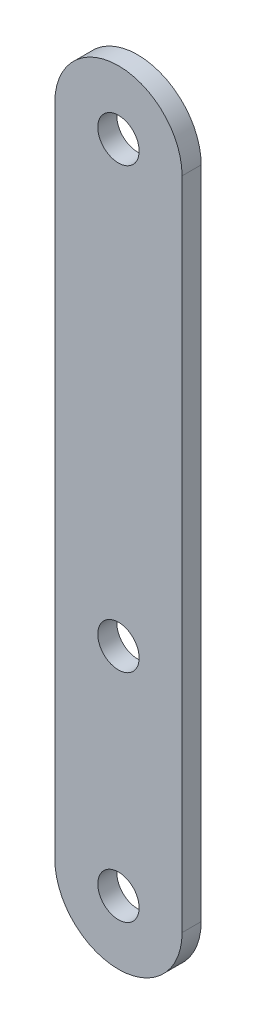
from build123d import *

# Parameters (mm, degrees)
SKETCH1_R      = 3.25
EXTRUDE1_DEPTH = 3


with BuildPart() as part:
    # Sketch1 → Extrude1 (new body)
    with BuildSketch(Plane.XY):
        with BuildLine():
            Line((10, 0), (10, 103))
            ThreePointArc((10, 103), (0, 113), (-10, 103))
            Line((-10, 103), (-10, 0))
            ThreePointArc((-10, 0), (0, -10), (10, 0))
        make_face()
        with Locations((0, 103)):
            Circle(SKETCH1_R, mode=Mode.SUBTRACT)
        Circle(SKETCH1_R, mode=Mode.SUBTRACT)
        with Locations((0, 34)):
            Circle(SKETCH1_R, mode=Mode.SUBTRACT)
    extrude(amount=EXTRUDE1_DEPTH)


solid = part.part
